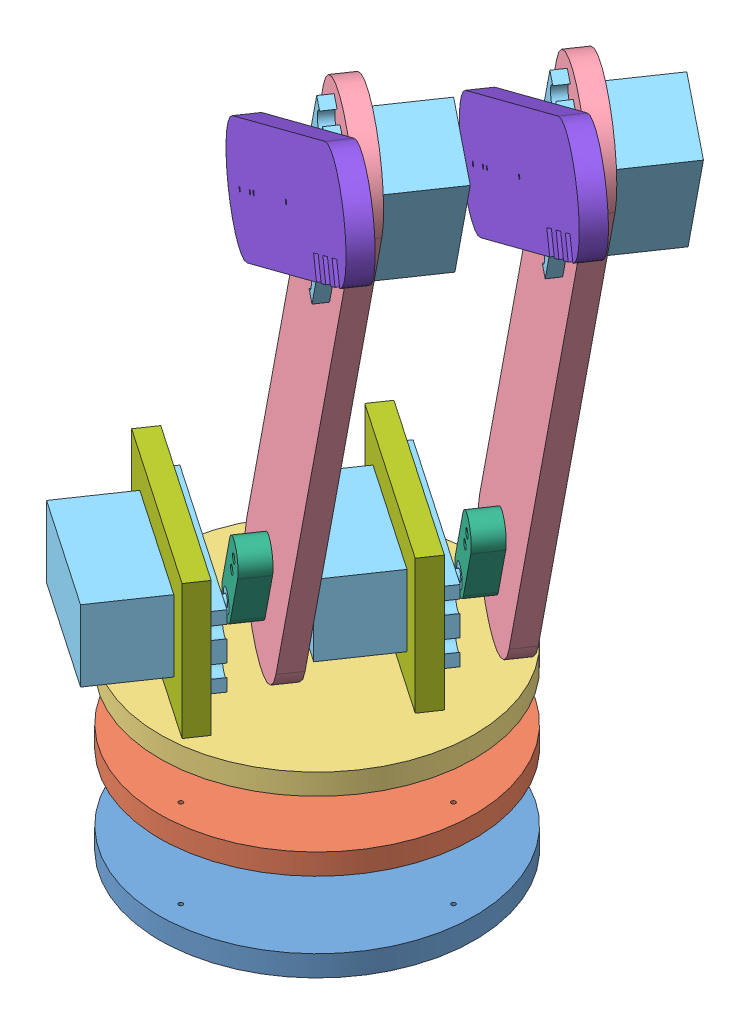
SolidWorks assembly FullAssembly.SLDASM, configuration Default (file format 10000). Lengths in mm.
Overall size (208.47 263.16 174.94).
19 component instances, 8 part files, 53 mates.
Components (placement in the parent):
- BaseBottomPlate-1: BaseBottomPlate.SLDPRT [Default] at (22.0119 33.9368 62.5622) size (75 5 75)
- BaseTopPlate-1: BaseTopPlate.SLDPRT [Default] at (22.0119 54.9368 62.5622) size (75 5 75)
- BottomArmPlate-1: BottomArmPlate.SLDPRT [Default] at (22.0119 71.4368 62.5622) x (-0.564301 0 0.825569) z (-0.825569 0 -0.564301) size (75 5 75)
- LowerArm-2: LowerArm.SLDPRT [Default] at (33.0422 86.0177 83.4259) x (-0.736385 0.45209 -0.503341) z (-0.373231 -0.891972 -0.255115) size (30 5 185)
- LowerArm-3: LowerArm.SLDPRT [Default] at (55.6142 86.0177 50.4031) x (-0.736385 0.45209 -0.503341) z (-0.373231 -0.891972 -0.255115) size (30 5 185)
- Servo-1: Servo.SLDPRT [Default] at (32.8332 83.9368 74.1984) x (0 1 0) z (-0.825569 0 -0.564301) size (17 29.5 43)
- Servo-2: Servo.SLDPRT [Default] at (109.13 237.5735 61.5457) x (0.736385 -0.45209 0.503341) z (-0.373231 -0.891972 -0.255115) size (17 29.5 43)
- Servo-3: Servo.SLDPRT [Default] at (10.2612 83.9368 107.2212) x (0 1 0) z (-0.825569 0 -0.564301) size (17 29.5 43)
- Servo-4: Servo.SLDPRT [Default] at (30.8742 38.9368 70.5622) x (-1 0 0) z (0 0 -1) size (17 29.5 43)
- ServoHorn-1: ServoHorn.SLDPRT [Default] at (24.6493 107.987 77.6891) x (0.736385 -0.45209 0.503341) z (-0.373231 -0.891972 -0.255115) size (8 6 23)
- ServoHorn-2: ServoHorn.SLDPRT [Default] at (106.5631 231.0626 99.1579) x (-0.441013 0.845362 -0.301446) z (-0.697905 -0.534193 -0.477039) size (8 6 23)
- ServoHorn-3: ServoHorn.SLDPRT [Default] at (47.2214 107.987 44.6663) x (0.736385 -0.45209 0.503341) z (-0.373231 -0.891972 -0.255115) size (8 6 23)
- ServoHorn-4: ServoHorn.SLDPRT [Default] at (11.8856 71.4368 50.7954) x (-0.564301 0 0.825569) z (0.825569 0 0.564301) size (8 6 23)
- ServoPlate-1: ServoPlate.SLDPRT [Default] at (48.0538 108.4368 65.2215) x (-0.825569 0 -0.564301) z (0 -1 0) size (46 5 37)
- ServoPlate-2: ServoPlate.SLDPRT [Default] at (-9.6729 108.4368 68.1586) x (0.825569 0 0.564301) z (0 -1 0) size (46 5 37)
- Servo-5: Servo.SLDPRT [Default] at (86.558 237.5735 94.5685) x (0.736385 -0.45209 0.503341) z (-0.373231 -0.891972 -0.255115) size (17 29.5 43)
- ServoHorn-5: ServoHorn.SLDPRT [Default] at (83.991 231.0626 132.1807) x (-0.441013 0.845362 -0.301446) z (-0.697905 -0.534193 -0.477039) size (8 6 23)
- UpperArm-1: UpperArm.SLDPRT [Default] at (136.0363 290.4175 167.7551) x (0.441013 -0.845362 0.301446) z (-0.697905 -0.534193 -0.477039) size (25 5 125)
- UpperArm-2: UpperArm.SLDPRT [Default] at (158.6083 290.4175 134.7323) x (0.441013 -0.845362 0.301446) z (-0.697905 -0.534193 -0.477039) size (25 5 125)
Mates (geometry in assembly coordinates):
- Concentric1: concentric aligned: circle of BaseBottomPlate-1; circle of BaseTopPlate-1
- Concentric2: concentric aligned: circle of BaseBottomPlate-1; circle of BaseTopPlate-1
- Concentric3: concentric aligned: circle of BaseBottomPlate-1; circle of BaseTopPlate-1
- Coincident5: coincident anti-aligned: plane of BaseTopPlate-1 through (22.0119 59.9368 62.5622) normal (0 1 0); plane of Servo-4 through (30.8742 59.9368 70.5622) normal (0 -1 0)
- Concentric4: concentric aligned: circle of BaseTopPlate-1; circle of Servo-4
- Coincident6: coincident anti-aligned: plane of BaseTopPlate-1 through (22.0119 59.9368 39.5622) normal (0 0 1); plane of Servo-4 through (30.8742 59.9368 39.5622) normal (0 0 -1)
- Concentric6: concentric anti-aligned: circle of Servo-4; circle of ServoHorn-4
- Coincident10: coincident anti-aligned: plane of Servo-4 through (22.0119 68.4368 62.5622) normal (0 1 0); plane of ServoHorn-4 through (22.0119 68.4368 62.5622) normal (0 -1 0)
- Concentric7: concentric anti-aligned: circle of BottomArmPlate-1; cylinder of ServoHorn-4 through (22.0119 65.4368 62.5622) axis (0 1 0) radius 1
- Concentric8: concentric aligned: circle of BottomArmPlate-1; circle of ServoHorn-4
- Coincident12: coincident anti-aligned: plane of BottomArmPlate-1 through (22.0119 71.4368 62.5622) normal (0 -1 0); plane of ServoHorn-4 through (9.6284 71.4368 54.0977) normal (0 1 0)
- Coincident13: coincident anti-aligned: plane of BottomArmPlate-1 through (22.0119 76.4368 62.5622) normal (0 1 0); plane of ServoPlate-2 through (13.0982 76.4368 89.7798) normal (0 -1 0)
- Coincident14: coincident anti-aligned: plane of BottomArmPlate-1 through (13.0982 66.4368 89.7798) normal (0.564301 0 -0.825569); plane of ServoPlate-2 through (-12.4944 108.4368 72.2865) normal (-0.564301 0 0.825569)
- Coincident15: coincident anti-aligned: plane of BottomArmPlate-1 through (-3.4811 66.4368 72.3909) normal (0.825569 0 0.564301); plane of ServoPlate-2 through (-6.3026 71.4368 76.5187) normal (-0.825569 0 -0.564301)
- Coincident16: coincident anti-aligned: plane of Servo-3 through (22.1115 83.9368 89.8842) normal (0 -1 0); plane of ServoPlate-2 through (-6.3026 83.9368 76.5187) normal (0 1 0)
- Coincident17: coincident anti-aligned: plane of Servo-3 through (22.1115 83.9368 89.8842) normal (-0.564301 0 0.825569); plane of ServoPlate-2 through (-9.6729 108.4368 68.1586) normal (0.564301 0 -0.825569)
- Coincident18: coincident anti-aligned: plane of Servo-3 through (-3.4811 83.9368 72.3909) normal (-0.825569 0 -0.564301); plane of ServoPlate-2 through (-6.3026 100.9368 76.5187) normal (0.825569 0 0.564301)
- Coincident19: coincident anti-aligned: plane of BottomArmPlate-1 through (22.0119 76.4368 62.5622) normal (0 1 0); plane of ServoPlate-1 through (25.2827 76.4368 43.6004) normal (0 -1 0)
- Concentric9: concentric anti-aligned: circle of Servo-1; circle of ServoHorn-3
- Coincident25: coincident anti-aligned: plane of Servo-1 through (42.8755 92.7991 45.3297) normal (0.564301 0 -0.825569); plane of ServoHorn-3 through (42.8755 92.7991 45.3297) normal (-0.564301 0 0.825569)
- Concentric10: concentric anti-aligned: circle of Servo-3; circle of ServoHorn-1
- Coincident26: coincident anti-aligned: plane of Servo-3 through (20.3035 92.7991 78.3525) normal (0.564301 0 -0.825569); plane of ServoHorn-1 through (20.3035 92.7991 78.3525) normal (-0.564301 0 0.825569)
- Concentric11: concentric anti-aligned: circle of LowerArm-3; circle of ServoHorn-3
- Concentric12: concentric anti-aligned: circle of LowerArm-3; circle of ServoHorn-3
- Coincident27: coincident anti-aligned: plane of LowerArm-3 through (44.5684 92.7991 42.853) normal (-0.564301 0 0.825569); plane of ServoHorn-3 through (50.1669 106.1787 46.6797) normal (0.564301 0 -0.825569)
- Concentric13: concentric anti-aligned: circle of LowerArm-2; circle of ServoHorn-1
- Concentric14: concentric anti-aligned: circle of LowerArm-2; circle of ServoHorn-1
- Coincident28: coincident anti-aligned: plane of LowerArm-2 through (21.9964 92.7991 75.8758) normal (-0.564301 0 0.825569); plane of ServoHorn-1 through (27.5949 106.1787 79.7025) normal (0.564301 0 -0.825569)
- Parallel1: parallel aligned: line of LowerArm-2 through (35.8637 86.0177 79.298) axis (0.373231 0.891972 0.255115); line of LowerArm-3 through (36.3442 99.5804 31.175) axis (0.373231 0.891972 0.255115)
- Coincident30: coincident anti-aligned: plane of BaseBottomPlate-1 through (22.0119 38.9368 62.5622) normal (0 1 0); plane of Servo-4 through (30.8742 38.9368 70.5622) normal (0 -1 0)
- Concentric15: concentric anti-aligned: circle of Servo-2; circle of ServoHorn-2
- Coincident31: coincident anti-aligned: plane of Servo-2 through (96.0233 226.4312 88.3198) normal (-0.564301 0 0.825569); plane of ServoHorn-2 through (96.0233 226.4312 88.3198) normal (0.564301 0 -0.825569)
- Coincident33: coincident anti-aligned: plane of Servo-1 through (44.6835 83.9368 56.8614) normal (-0.564301 0 0.825569); plane of ServoPlate-1 through (50.8753 108.4368 61.0937) normal (0.564301 0 -0.825569)
- Coincident34: coincident anti-aligned: plane of Servo-1 through (19.0909 100.9368 39.3681) normal (0 1 0); plane of ServoPlate-1 through (19.0909 100.9368 39.3681) normal (0 -1 0)
- Coincident35: coincident anti-aligned: plane of Servo-1 through (19.0909 83.9368 39.3681) normal (-0.825569 0 -0.564301); plane of ServoPlate-1 through (19.0909 83.9368 39.3681) normal (0.825569 0 0.564301)
- Coincident37: coincident anti-aligned: plane of LowerArm-3 through (44.5684 92.7991 42.853) normal (-0.564301 0 0.825569); plane of Servo-2 through (97.2797 237.5735 78.8827) normal (0.564301 0 -0.825569)
- Parallel2: parallel anti-aligned: line of LowerArm-3 through (33.5227 99.5804 35.3029) axis (0.373231 0.891972 0.255115); line of Servo-2 through (97.8262 242.9253 82.8901) axis (-0.373231 -0.891972 -0.255115)
- Coincident39: coincident anti-aligned: plane of BottomArmPlate-1 through (19.0909 66.4368 39.3681) normal (0.825569 0 0.564301); plane of ServoPlate-1 through (19.0909 71.4368 39.3681) normal (-0.825569 0 -0.564301)
- Coincident40: coincident anti-aligned: plane of BottomArmPlate-1 through (25.2827 66.4368 43.6004) normal (-0.564301 0 0.825569); plane of ServoPlate-1 through (50.8753 108.4368 61.0937) normal (0.564301 0 -0.825569)
- Coincident42: coincident anti-aligned: plane of LowerArm-3 through (97.2797 237.5735 78.8827) normal (0.736385 -0.45209 0.503341); plane of Servo-2 through (97.2797 237.5735 78.8827) normal (-0.736385 0.45209 -0.503341)
- Coincident43: coincident anti-aligned: plane of LowerArm-3 through (109.7983 229.888 87.4395) normal (-0.373231 -0.891972 -0.255115); plane of Servo-2 through (109.7983 229.888 87.4395) normal (0.373231 0.891972 0.255115)
- Concentric16: concentric anti-aligned: circle of Servo-5; circle of ServoHorn-5
- Coincident44: coincident anti-aligned: plane of Servo-5 through (73.4513 226.4312 121.3426) normal (-0.564301 0 0.825569); plane of ServoHorn-5 through (73.4513 226.4312 121.3426) normal (0.564301 0 -0.825569)
- Coincident45: coincident anti-aligned: plane of LowerArm-2 through (75.6561 202.2368 112.5537) normal (-0.736385 0.45209 -0.503341); plane of Servo-5 through (75.6561 202.2368 112.5537) normal (0.736385 -0.45209 0.503341)
- Coincident47: coincident anti-aligned: plane of LowerArm-2 through (87.2262 229.888 120.4623) normal (-0.373231 -0.891972 -0.255115); plane of Servo-5 through (87.2262 229.888 120.4623) normal (0.373231 0.891972 0.255115)
- Coincident48: coincident anti-aligned: plane of LowerArm-2 through (21.9964 92.7991 75.8758) normal (-0.564301 0 0.825569); plane of Servo-5 through (74.7077 237.5735 111.9055) normal (0.564301 0 -0.825569)
- Concentric17: concentric anti-aligned: circle of ServoHorn-5; circle of UpperArm-1
- Coincident49: coincident anti-aligned: plane of ServoHorn-5 through (82.227 234.4441 130.9749) normal (-0.564301 0 0.825569); plane of UpperArm-1 through (141.5489 279.8505 171.5232) normal (0.564301 0 -0.825569)
- Concentric18: concentric anti-aligned: circle of ServoHorn-5; circle of UpperArm-1
- Coincident51: coincident anti-aligned: plane of ServoHorn-2 through (104.799 234.4441 97.9521) normal (-0.564301 0 0.825569); plane of UpperArm-2 through (164.121 279.8505 138.5004) normal (0.564301 0 -0.825569)
- Concentric19: concentric anti-aligned: circle of ServoHorn-2; circle of UpperArm-2
- Concentric20: concentric anti-aligned: circle of ServoHorn-2; circle of UpperArm-2
- Parallel3: parallel aligned: line of UpperArm-1 through (133.2148 290.4175 171.883) axis (-0.697905 -0.534193 -0.477039); line of UpperArm-2 through (155.7868 290.4175 138.8602) axis (-0.697905 -0.534193 -0.477039)
